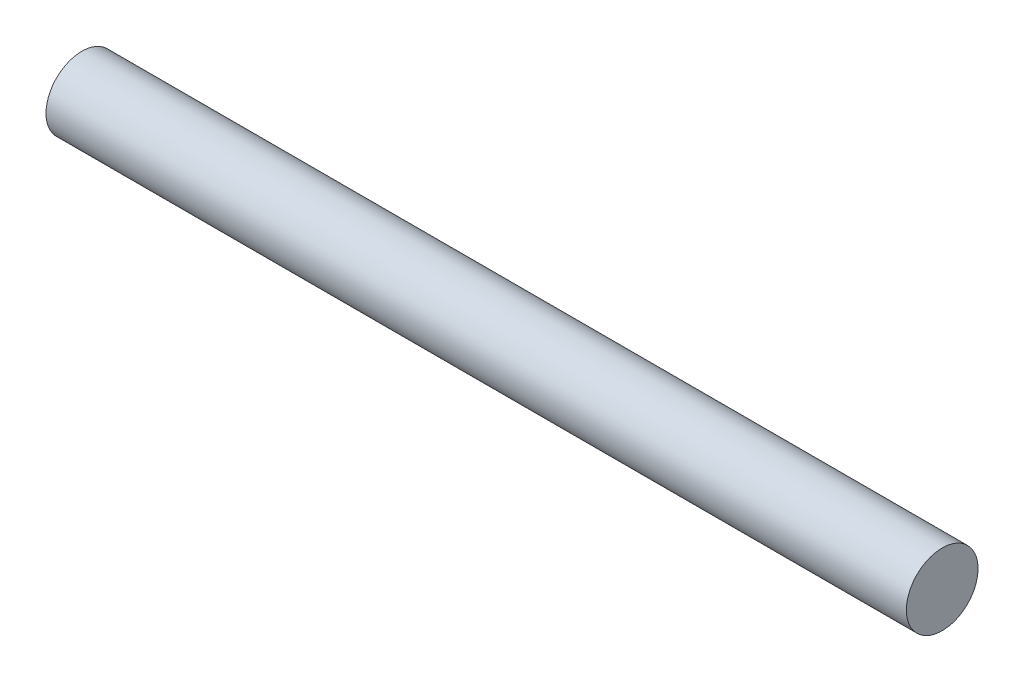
ISO-10303-21;
HEADER;
FILE_DESCRIPTION(('STEP AP214'),'2;1');
FILE_NAME('part.step','',(''),(''),'','','');
FILE_SCHEMA(('AUTOMOTIVE_DESIGN { 1 0 10303 214 1 1 1 1 }'));
ENDSEC;
DATA;
#1=APPLICATION_CONTEXT('core data for automotive mechanical design processes');
#2=APPLICATION_PROTOCOL_DEFINITION('international standard','automotive_design',2000,#1);
#3=PRODUCT_CONTEXT('',#1,'mechanical');
#4=PRODUCT('Part','Part','',(#3));
#5=PRODUCT_RELATED_PRODUCT_CATEGORY('part','',(#4));
#6=PRODUCT_DEFINITION_FORMATION('','',#4);
#7=PRODUCT_DEFINITION_CONTEXT('part definition',#1,'design');
#8=PRODUCT_DEFINITION('design','',#6,#7);
#9=PRODUCT_DEFINITION_SHAPE('','',#8);
#10=(LENGTH_UNIT() NAMED_UNIT(*) SI_UNIT(.MILLI.,.METRE.));
#11=(NAMED_UNIT(*) PLANE_ANGLE_UNIT() SI_UNIT($,.RADIAN.));
#12=(NAMED_UNIT(*) SI_UNIT($,.STERADIAN.) SOLID_ANGLE_UNIT());
#13=UNCERTAINTY_MEASURE_WITH_UNIT(LENGTH_MEASURE(1.E-05),#10,'distance_accuracy_value','');
#14=(GEOMETRIC_REPRESENTATION_CONTEXT(3) GLOBAL_UNCERTAINTY_ASSIGNED_CONTEXT((#13)) GLOBAL_UNIT_ASSIGNED_CONTEXT((#10,
#11,#12)) REPRESENTATION_CONTEXT('',''));
#15=CARTESIAN_POINT('',(0.,0.,0.));
#16=DIRECTION('',(0.,0.,1.));
#17=DIRECTION('',(1.,0.,0.));
#18=AXIS2_PLACEMENT_3D('',#15,#16,#17);
#19=CARTESIAN_POINT('',(38.1,0.,0.));
#20=DIRECTION('',(-1.,0.,0.));
#21=DIRECTION('',(0.,0.,1.));
#22=AXIS2_PLACEMENT_3D('',#19,#20,#21);
#23=CYLINDRICAL_SURFACE('',#22,3.175);
#24=CARTESIAN_POINT('',(38.1,0.,0.));
#25=DIRECTION('',(1.,0.,0.));
#26=DIRECTION('',(0.,0.,-1.));
#27=AXIS2_PLACEMENT_3D('',#24,#25,#26);
#28=CIRCLE('',#27,3.175);
#29=CARTESIAN_POINT('',(38.1,0.,3.175));
#30=VERTEX_POINT('',#29);
#31=EDGE_CURVE('E10',#30,#30,#28,.T.);
#32=CARTESIAN_POINT('',(-38.1,0.,0.));
#33=DIRECTION('',(1.,0.,0.));
#34=DIRECTION('',(0.,0.,-1.));
#35=AXIS2_PLACEMENT_3D('',#32,#33,#34);
#36=CIRCLE('',#35,3.175);
#37=CARTESIAN_POINT('',(-38.1,0.,3.175));
#38=VERTEX_POINT('',#37);
#39=EDGE_CURVE('E42',#38,#38,#36,.T.);
#40=CARTESIAN_POINT('',(38.1,0.,3.175));
#41=CARTESIAN_POINT('',(37.30625,0.,3.175));
#42=CARTESIAN_POINT('',(36.5125,0.,3.175));
#43=CARTESIAN_POINT('',(34.925,0.,3.175));
#44=CARTESIAN_POINT('',(34.13125,0.,3.175));
#45=CARTESIAN_POINT('',(32.54375,0.,3.175));
#46=CARTESIAN_POINT('',(31.75,0.,3.175));
#47=CARTESIAN_POINT('',(30.1625,0.,3.175));
#48=CARTESIAN_POINT('',(29.36875,0.,3.175));
#49=CARTESIAN_POINT('',(27.78125,0.,3.175));
#50=CARTESIAN_POINT('',(26.9875,0.,3.175));
#51=CARTESIAN_POINT('',(25.4,0.,3.175));
#52=CARTESIAN_POINT('',(24.60625,0.,3.175));
#53=CARTESIAN_POINT('',(23.01875,0.,3.175));
#54=CARTESIAN_POINT('',(22.225,0.,3.175));
#55=CARTESIAN_POINT('',(20.6375,0.,3.175));
#56=CARTESIAN_POINT('',(19.84375,0.,3.175));
#57=CARTESIAN_POINT('',(18.25625,0.,3.175));
#58=CARTESIAN_POINT('',(17.4625,0.,3.175));
#59=CARTESIAN_POINT('',(15.875,0.,3.175));
#60=CARTESIAN_POINT('',(15.08125,0.,3.175));
#61=CARTESIAN_POINT('',(13.49375,0.,3.175));
#62=CARTESIAN_POINT('',(12.7,0.,3.175));
#63=CARTESIAN_POINT('',(11.1125,0.,3.175));
#64=CARTESIAN_POINT('',(10.31875,0.,3.175));
#65=CARTESIAN_POINT('',(8.73124999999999,0.,3.175));
#66=CARTESIAN_POINT('',(7.93749999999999,0.,3.175));
#67=CARTESIAN_POINT('',(6.35,0.,3.175));
#68=CARTESIAN_POINT('',(5.55625,0.,3.175));
#69=CARTESIAN_POINT('',(3.96875,0.,3.175));
#70=CARTESIAN_POINT('',(3.175,0.,3.175));
#71=CARTESIAN_POINT('',(1.5875,0.,3.175));
#72=CARTESIAN_POINT('',(0.793750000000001,0.,3.175));
#73=CARTESIAN_POINT('',(-0.793750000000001,0.,3.175));
#74=CARTESIAN_POINT('',(-1.5875,0.,3.175));
#75=CARTESIAN_POINT('',(-3.175,0.,3.175));
#76=CARTESIAN_POINT('',(-3.96875,0.,3.175));
#77=CARTESIAN_POINT('',(-5.55625,0.,3.175));
#78=CARTESIAN_POINT('',(-6.35,0.,3.175));
#79=CARTESIAN_POINT('',(-7.93750000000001,0.,3.175));
#80=CARTESIAN_POINT('',(-8.73125,0.,3.175));
#81=CARTESIAN_POINT('',(-10.31875,0.,3.175));
#82=CARTESIAN_POINT('',(-11.1125,0.,3.175));
#83=CARTESIAN_POINT('',(-12.7,0.,3.175));
#84=CARTESIAN_POINT('',(-13.49375,0.,3.175));
#85=CARTESIAN_POINT('',(-15.08125,0.,3.175));
#86=CARTESIAN_POINT('',(-15.875,0.,3.175));
#87=CARTESIAN_POINT('',(-17.4625,0.,3.175));
#88=CARTESIAN_POINT('',(-18.25625,0.,3.175));
#89=CARTESIAN_POINT('',(-19.84375,0.,3.175));
#90=CARTESIAN_POINT('',(-20.6375,0.,3.175));
#91=CARTESIAN_POINT('',(-22.225,0.,3.175));
#92=CARTESIAN_POINT('',(-23.01875,0.,3.175));
#93=CARTESIAN_POINT('',(-24.60625,0.,3.175));
#94=CARTESIAN_POINT('',(-25.4,0.,3.175));
#95=CARTESIAN_POINT('',(-26.9875,0.,3.175));
#96=CARTESIAN_POINT('',(-27.78125,0.,3.175));
#97=CARTESIAN_POINT('',(-29.36875,0.,3.175));
#98=CARTESIAN_POINT('',(-30.1625,0.,3.175));
#99=CARTESIAN_POINT('',(-31.75,0.,3.175));
#100=CARTESIAN_POINT('',(-32.54375,0.,3.175));
#101=CARTESIAN_POINT('',(-34.13125,0.,3.175));
#102=CARTESIAN_POINT('',(-34.925,0.,3.175));
#103=CARTESIAN_POINT('',(-36.5125,0.,3.175));
#104=CARTESIAN_POINT('',(-37.30625,0.,3.175));
#105=CARTESIAN_POINT('',(-38.1,0.,3.175));
#106=B_SPLINE_CURVE_WITH_KNOTS('',3,(#40,#41,#42,#43,#44,#45,#46,#47,#48,#49,#50,#51,#52,#53,
#54,#55,#56,#57,#58,#59,#60,#61,#62,#63,#64,#65,#66,#67,#68,#69,#70,#71,#72,#73,#74,#75,#76,#77,
#78,#79,#80,#81,#82,#83,#84,#85,#86,#87,#88,#89,#90,#91,#92,#93,#94,#95,#96,#97,#98,#99,#100,
#101,#102,#103,#104,#105),.UNSPECIFIED.,.F.,.F.,(4,2,2,2,2,2,2,2,2,2,2,2,2,2,2,2,2,2,2,2,2,2,2,
2,2,2,2,2,2,2,2,2,4),(0.,2.38125,4.7625,7.14375,9.52500000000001,11.90625,14.2875,16.66875,
19.05,21.43125,23.8125,26.19375,28.575,30.95625,33.3375,35.71875,38.1,40.48125,42.8625,45.24375,
47.625,50.00625,52.3875,54.76875,57.15,59.53125,61.9125,64.29375,66.675,69.05625,71.4375,
73.81875,76.2),.UNSPECIFIED.);
#107=EDGE_CURVE('BSEAM39',#30,#38,#106,.T.);
#108=ORIENTED_EDGE('',*,*,#31,.F.);
#109=ORIENTED_EDGE('',*,*,#39,.T.);
#110=ORIENTED_EDGE('',*,*,#107,.T.);
#111=ORIENTED_EDGE('',*,*,#107,.F.);
#112=EDGE_LOOP('',(#108,#110,#109,#111));
#113=FACE_BOUND('',#112,.T.);
#114=ADVANCED_FACE('F39',(#113),#23,.T.);
#115=CARTESIAN_POINT('',(38.1,0.,0.));
#116=DIRECTION('',(1.,0.,0.));
#117=DIRECTION('',(0.,0.,-1.));
#118=AXIS2_PLACEMENT_3D('',#115,#116,#117);
#119=PLANE('',#118);
#120=ORIENTED_EDGE('',*,*,#31,.T.);
#121=EDGE_LOOP('',(#120));
#122=FACE_BOUND('',#121,.T.);
#123=ADVANCED_FACE('F54',(#122),#119,.T.);
#124=CARTESIAN_POINT('',(-38.1,0.,0.));
#125=DIRECTION('',(1.,0.,0.));
#126=DIRECTION('',(0.,0.,-1.));
#127=AXIS2_PLACEMENT_3D('',#124,#125,#126);
#128=PLANE('',#127);
#129=ORIENTED_EDGE('',*,*,#39,.F.);
#130=EDGE_LOOP('',(#129));
#131=FACE_BOUND('',#130,.T.);
#132=ADVANCED_FACE('F52',(#131),#128,.F.);
#133=CLOSED_SHELL('',(#114,#123,#132));
#134=MANIFOLD_SOLID_BREP('B2',#133);
#135=ADVANCED_BREP_SHAPE_REPRESENTATION('',(#18,#134),#14);
#136=SHAPE_DEFINITION_REPRESENTATION(#9,#135);
ENDSEC;
END-ISO-10303-21;
